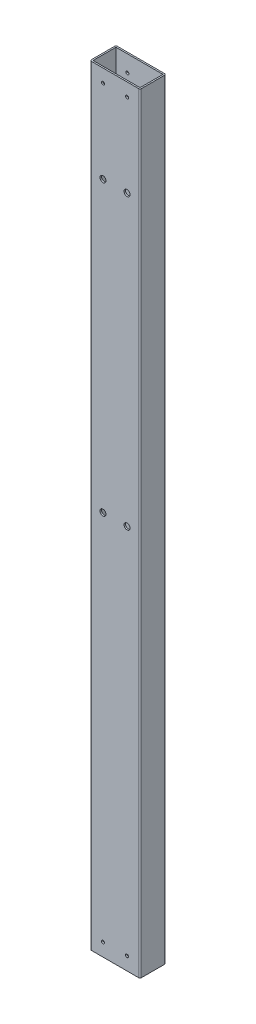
ISO-10303-21;
HEADER;
FILE_DESCRIPTION(('STEP AP214'),'2;1');
FILE_NAME('part.step','',(''),(''),'','','');
FILE_SCHEMA(('AUTOMOTIVE_DESIGN { 1 0 10303 214 1 1 1 1 }'));
ENDSEC;
DATA;
#1=APPLICATION_CONTEXT('core data for automotive mechanical design processes');
#2=APPLICATION_PROTOCOL_DEFINITION('international standard','automotive_design',2000,#1);
#3=PRODUCT_CONTEXT('',#1,'mechanical');
#4=PRODUCT('Part','Part','',(#3));
#5=PRODUCT_RELATED_PRODUCT_CATEGORY('part','',(#4));
#6=PRODUCT_DEFINITION_FORMATION('','',#4);
#7=PRODUCT_DEFINITION_CONTEXT('part definition',#1,'design');
#8=PRODUCT_DEFINITION('design','',#6,#7);
#9=PRODUCT_DEFINITION_SHAPE('','',#8);
#10=(LENGTH_UNIT() NAMED_UNIT(*) SI_UNIT(.MILLI.,.METRE.));
#11=(NAMED_UNIT(*) PLANE_ANGLE_UNIT() SI_UNIT($,.RADIAN.));
#12=(NAMED_UNIT(*) SI_UNIT($,.STERADIAN.) SOLID_ANGLE_UNIT());
#13=UNCERTAINTY_MEASURE_WITH_UNIT(LENGTH_MEASURE(1.E-05),#10,'distance_accuracy_value','');
#14=(GEOMETRIC_REPRESENTATION_CONTEXT(3) GLOBAL_UNCERTAINTY_ASSIGNED_CONTEXT((#13)) GLOBAL_UNIT_ASSIGNED_CONTEXT((#10,
#11,#12)) REPRESENTATION_CONTEXT('',''));
#15=CARTESIAN_POINT('',(0.,0.,0.));
#16=DIRECTION('',(0.,0.,1.));
#17=DIRECTION('',(1.,0.,0.));
#18=AXIS2_PLACEMENT_3D('',#15,#16,#17);
#19=CARTESIAN_POINT('',(-24.8285,406.4,12.1285));
#20=DIRECTION('',(0.,1.,0.));
#21=DIRECTION('',(0.,0.,1.));
#22=AXIS2_PLACEMENT_3D('',#19,#20,#21);
#23=PLANE('',#22);
#24=CARTESIAN_POINT('',(-24.8285,406.4,12.1285));
#25=DIRECTION('',(0.,1.,0.));
#26=DIRECTION('',(0.,0.,-1.));
#27=AXIS2_PLACEMENT_3D('',#24,#25,#26);
#28=CIRCLE('',#27,1.5875);
#29=CARTESIAN_POINT('',(-26.416,406.4,12.1285));
#30=VERTEX_POINT('',#29);
#31=CARTESIAN_POINT('',(-24.8285,406.4,13.716));
#32=VERTEX_POINT('',#31);
#33=EDGE_CURVE('E226',#30,#32,#28,.T.);
#34=ORIENTED_EDGE('',*,*,#33,.T.);
#35=DIRECTION('',(1.,0.,0.));
#36=VECTOR('',#35,1.);
#37=CARTESIAN_POINT('',(-24.8285,406.4,13.716));
#38=LINE('',#37,#36);
#39=CARTESIAN_POINT('',(24.8285,406.4,13.716));
#40=VERTEX_POINT('',#39);
#41=EDGE_CURVE('E230',#32,#40,#38,.T.);
#42=ORIENTED_EDGE('',*,*,#41,.T.);
#43=CARTESIAN_POINT('',(24.8285,406.4,12.1285));
#44=DIRECTION('',(0.,1.,0.));
#45=DIRECTION('',(0.,0.,1.));
#46=AXIS2_PLACEMENT_3D('',#43,#44,#45);
#47=CIRCLE('',#46,1.5875);
#48=CARTESIAN_POINT('',(26.416,406.4,12.1285));
#49=VERTEX_POINT('',#48);
#50=EDGE_CURVE('E234',#40,#49,#47,.T.);
#51=ORIENTED_EDGE('',*,*,#50,.T.);
#52=DIRECTION('',(0.,0.,-1.));
#53=VECTOR('',#52,1.);
#54=CARTESIAN_POINT('',(26.416,406.4,12.1285));
#55=LINE('',#54,#53);
#56=CARTESIAN_POINT('',(26.416,406.4,-12.1285));
#57=VERTEX_POINT('',#56);
#58=EDGE_CURVE('E237',#49,#57,#55,.T.);
#59=ORIENTED_EDGE('',*,*,#58,.T.);
#60=CARTESIAN_POINT('',(24.8285,406.4,-12.1285));
#61=DIRECTION('',(0.,1.,0.));
#62=DIRECTION('',(0.,0.,-1.));
#63=AXIS2_PLACEMENT_3D('',#60,#61,#62);
#64=CIRCLE('',#63,1.5875);
#65=CARTESIAN_POINT('',(24.8285,406.4,-13.716));
#66=VERTEX_POINT('',#65);
#67=EDGE_CURVE('E240',#57,#66,#64,.T.);
#68=ORIENTED_EDGE('',*,*,#67,.T.);
#69=DIRECTION('',(-1.,0.,0.));
#70=VECTOR('',#69,1.);
#71=CARTESIAN_POINT('',(-24.8285,406.4,-13.716));
#72=LINE('',#71,#70);
#73=CARTESIAN_POINT('',(-24.8285,406.4,-13.716));
#74=VERTEX_POINT('',#73);
#75=EDGE_CURVE('E243',#66,#74,#72,.T.);
#76=ORIENTED_EDGE('',*,*,#75,.T.);
#77=CARTESIAN_POINT('',(-24.8285,406.4,-12.1285));
#78=DIRECTION('',(0.,1.,0.));
#79=DIRECTION('',(0.,0.,-1.));
#80=AXIS2_PLACEMENT_3D('',#77,#78,#79);
#81=CIRCLE('',#80,1.5875);
#82=CARTESIAN_POINT('',(-26.416,406.4,-12.1285));
#83=VERTEX_POINT('',#82);
#84=EDGE_CURVE('E246',#74,#83,#81,.T.);
#85=ORIENTED_EDGE('',*,*,#84,.T.);
#86=DIRECTION('',(0.,0.,1.));
#87=VECTOR('',#86,1.);
#88=CARTESIAN_POINT('',(-26.416,406.4,12.1285));
#89=LINE('',#88,#87);
#90=EDGE_CURVE('E249',#83,#30,#89,.T.);
#91=ORIENTED_EDGE('',*,*,#90,.T.);
#92=EDGE_LOOP('',(#34,#42,#51,#59,#68,#76,#85,#91));
#93=FACE_BOUND('',#92,.T.);
#94=DIRECTION('',(1.,0.,0.));
#95=VECTOR('',#94,1.);
#96=CARTESIAN_POINT('',(-24.8285,406.4,12.1285));
#97=LINE('',#96,#95);
#98=CARTESIAN_POINT('',(-24.8285,406.4,12.1285));
#99=VERTEX_POINT('',#98);
#100=CARTESIAN_POINT('',(24.8285,406.4,12.1285));
#101=VERTEX_POINT('',#100);
#102=EDGE_CURVE('E185',#99,#101,#97,.T.);
#103=ORIENTED_EDGE('',*,*,#102,.F.);
#104=DIRECTION('',(0.,0.,1.));
#105=VECTOR('',#104,1.);
#106=CARTESIAN_POINT('',(-24.8285,406.4,12.1285));
#107=LINE('',#106,#105);
#108=CARTESIAN_POINT('',(-24.8285,406.4,-12.1285));
#109=VERTEX_POINT('',#108);
#110=EDGE_CURVE('E176',#109,#99,#107,.T.);
#111=ORIENTED_EDGE('',*,*,#110,.F.);
#112=DIRECTION('',(-1.,0.,0.));
#113=VECTOR('',#112,1.);
#114=CARTESIAN_POINT('',(-24.8285,406.4,-12.1285));
#115=LINE('',#114,#113);
#116=CARTESIAN_POINT('',(24.8285,406.4,-12.1285));
#117=VERTEX_POINT('',#116);
#118=EDGE_CURVE('E202',#117,#109,#115,.T.);
#119=ORIENTED_EDGE('',*,*,#118,.F.);
#120=DIRECTION('',(0.,0.,-1.));
#121=VECTOR('',#120,1.);
#122=CARTESIAN_POINT('',(24.8285,406.4,12.1285));
#123=LINE('',#122,#121);
#124=EDGE_CURVE('E198',#101,#117,#123,.T.);
#125=ORIENTED_EDGE('',*,*,#124,.F.);
#126=EDGE_LOOP('',(#103,#111,#119,#125));
#127=FACE_BOUND('',#126,.T.);
#128=ADVANCED_FACE('F84',(#93,#127),#23,.T.);
#129=CARTESIAN_POINT('',(-24.8285,-406.4,12.1285));
#130=DIRECTION('',(0.,1.,0.));
#131=DIRECTION('',(0.,0.,1.));
#132=AXIS2_PLACEMENT_3D('',#129,#130,#131);
#133=PLANE('',#132);
#134=CARTESIAN_POINT('',(-24.8285,-406.4,12.1285));
#135=DIRECTION('',(0.,1.,0.));
#136=DIRECTION('',(0.,0.,-1.));
#137=AXIS2_PLACEMENT_3D('',#134,#135,#136);
#138=CIRCLE('',#137,1.5875);
#139=CARTESIAN_POINT('',(-26.416,-406.4,12.1285));
#140=VERTEX_POINT('',#139);
#141=CARTESIAN_POINT('',(-24.8285,-406.4,13.716));
#142=VERTEX_POINT('',#141);
#143=EDGE_CURVE('E194',#140,#142,#138,.T.);
#144=ORIENTED_EDGE('',*,*,#143,.F.);
#145=DIRECTION('',(0.,0.,1.));
#146=VECTOR('',#145,1.);
#147=CARTESIAN_POINT('',(-26.416,-406.4,12.1285));
#148=LINE('',#147,#146);
#149=CARTESIAN_POINT('',(-26.416,-406.4,-12.1285));
#150=VERTEX_POINT('',#149);
#151=EDGE_CURVE('E231',#150,#140,#148,.T.);
#152=ORIENTED_EDGE('',*,*,#151,.F.);
#153=CARTESIAN_POINT('',(-24.8285,-406.4,-12.1285));
#154=DIRECTION('',(0.,1.,0.));
#155=DIRECTION('',(0.,0.,-1.));
#156=AXIS2_PLACEMENT_3D('',#153,#154,#155);
#157=CIRCLE('',#156,1.5875);
#158=CARTESIAN_POINT('',(-24.8285,-406.4,-13.716));
#159=VERTEX_POINT('',#158);
#160=EDGE_CURVE('E271',#159,#150,#157,.T.);
#161=ORIENTED_EDGE('',*,*,#160,.F.);
#162=DIRECTION('',(-1.,0.,0.));
#163=VECTOR('',#162,1.);
#164=CARTESIAN_POINT('',(-24.8285,-406.4,-13.716));
#165=LINE('',#164,#163);
#166=CARTESIAN_POINT('',(24.8285,-406.4,-13.716));
#167=VERTEX_POINT('',#166);
#168=EDGE_CURVE('E268',#167,#159,#165,.T.);
#169=ORIENTED_EDGE('',*,*,#168,.F.);
#170=CARTESIAN_POINT('',(24.8285,-406.4,-12.1285));
#171=DIRECTION('',(0.,1.,0.));
#172=DIRECTION('',(0.,0.,-1.));
#173=AXIS2_PLACEMENT_3D('',#170,#171,#172);
#174=CIRCLE('',#173,1.5875);
#175=CARTESIAN_POINT('',(26.416,-406.4,-12.1285));
#176=VERTEX_POINT('',#175);
#177=EDGE_CURVE('E265',#176,#167,#174,.T.);
#178=ORIENTED_EDGE('',*,*,#177,.F.);
#179=DIRECTION('',(0.,0.,-1.));
#180=VECTOR('',#179,1.);
#181=CARTESIAN_POINT('',(26.416,-406.4,12.1285));
#182=LINE('',#181,#180);
#183=CARTESIAN_POINT('',(26.416,-406.4,12.1285));
#184=VERTEX_POINT('',#183);
#185=EDGE_CURVE('E262',#184,#176,#182,.T.);
#186=ORIENTED_EDGE('',*,*,#185,.F.);
#187=CARTESIAN_POINT('',(24.8285,-406.4,12.1285));
#188=DIRECTION('',(0.,1.,0.));
#189=DIRECTION('',(0.,0.,1.));
#190=AXIS2_PLACEMENT_3D('',#187,#188,#189);
#191=CIRCLE('',#190,1.5875);
#192=CARTESIAN_POINT('',(24.8285,-406.4,13.716));
#193=VERTEX_POINT('',#192);
#194=EDGE_CURVE('E259',#193,#184,#191,.T.);
#195=ORIENTED_EDGE('',*,*,#194,.F.);
#196=DIRECTION('',(1.,0.,0.));
#197=VECTOR('',#196,1.);
#198=CARTESIAN_POINT('',(-24.8285,-406.4,13.716));
#199=LINE('',#198,#197);
#200=EDGE_CURVE('E256',#142,#193,#199,.T.);
#201=ORIENTED_EDGE('',*,*,#200,.F.);
#202=EDGE_LOOP('',(#144,#152,#161,#169,#178,#186,#195,#201));
#203=FACE_BOUND('',#202,.T.);
#204=DIRECTION('',(0.,0.,1.));
#205=VECTOR('',#204,1.);
#206=CARTESIAN_POINT('',(-24.8285,-406.4,12.1285));
#207=LINE('',#206,#205);
#208=CARTESIAN_POINT('',(-24.8285,-406.4,-12.1285));
#209=VERTEX_POINT('',#208);
#210=CARTESIAN_POINT('',(-24.8285,-406.4,12.1285));
#211=VERTEX_POINT('',#210);
#212=EDGE_CURVE('E110',#209,#211,#207,.T.);
#213=ORIENTED_EDGE('',*,*,#212,.T.);
#214=DIRECTION('',(1.,0.,0.));
#215=VECTOR('',#214,1.);
#216=CARTESIAN_POINT('',(-24.8285,-406.4,12.1285));
#217=LINE('',#216,#215);
#218=CARTESIAN_POINT('',(24.8285,-406.4,12.1285));
#219=VERTEX_POINT('',#218);
#220=EDGE_CURVE('E192',#211,#219,#217,.T.);
#221=ORIENTED_EDGE('',*,*,#220,.T.);
#222=DIRECTION('',(0.,0.,-1.));
#223=VECTOR('',#222,1.);
#224=CARTESIAN_POINT('',(24.8285,-406.4,12.1285));
#225=LINE('',#224,#223);
#226=CARTESIAN_POINT('',(24.8285,-406.4,-12.1285));
#227=VERTEX_POINT('',#226);
#228=EDGE_CURVE('E213',#219,#227,#225,.T.);
#229=ORIENTED_EDGE('',*,*,#228,.T.);
#230=DIRECTION('',(-1.,0.,0.));
#231=VECTOR('',#230,1.);
#232=CARTESIAN_POINT('',(-24.8285,-406.4,-12.1285));
#233=LINE('',#232,#231);
#234=EDGE_CURVE('E186',#227,#209,#233,.T.);
#235=ORIENTED_EDGE('',*,*,#234,.T.);
#236=EDGE_LOOP('',(#213,#221,#229,#235));
#237=FACE_BOUND('',#236,.T.);
#238=ADVANCED_FACE('F452',(#203,#237),#133,.F.);
#239=CARTESIAN_POINT('',(-24.8285,406.4,12.1285));
#240=DIRECTION('',(0.,-1.,0.));
#241=DIRECTION('',(0.,0.,-1.));
#242=AXIS2_PLACEMENT_3D('',#239,#240,#241);
#243=CYLINDRICAL_SURFACE('',#242,1.5875);
#244=ORIENTED_EDGE('',*,*,#143,.T.);
#245=DIRECTION('',(0.,-1.,0.));
#246=VECTOR('',#245,1.);
#247=CARTESIAN_POINT('',(-24.8285,406.4,13.716));
#248=LINE('',#247,#246);
#249=EDGE_CURVE('E12',#32,#142,#248,.T.);
#250=ORIENTED_EDGE('',*,*,#249,.F.);
#251=ORIENTED_EDGE('',*,*,#33,.F.);
#252=DIRECTION('',(0.,-1.,0.));
#253=VECTOR('',#252,1.);
#254=CARTESIAN_POINT('',(-26.416,406.4,12.1285));
#255=LINE('',#254,#253);
#256=EDGE_CURVE('E252',#30,#140,#255,.T.);
#257=ORIENTED_EDGE('',*,*,#256,.T.);
#258=EDGE_LOOP('',(#244,#250,#251,#257));
#259=FACE_BOUND('',#258,.T.);
#260=ADVANCED_FACE('F86',(#259),#243,.T.);
#261=CARTESIAN_POINT('',(-24.8285,406.4,13.716));
#262=DIRECTION('',(0.,0.,-1.));
#263=DIRECTION('',(-1.,0.,0.));
#264=AXIS2_PLACEMENT_3D('',#261,#262,#263);
#265=PLANE('',#264);
#266=CARTESIAN_POINT('',(-12.7,-392.557,13.716));
#267=DIRECTION('',(0.,0.,1.));
#268=DIRECTION('',(1.,0.,0.));
#269=AXIS2_PLACEMENT_3D('',#266,#267,#268);
#270=CIRCLE('',#269,1.5875);
#271=CARTESIAN_POINT('',(-11.1125,-392.557,13.716));
#272=VERTEX_POINT('',#271);
#273=EDGE_CURVE('E355',#272,#272,#270,.T.);
#274=ORIENTED_EDGE('',*,*,#273,.F.);
#275=EDGE_LOOP('',(#274));
#276=FACE_BOUND('',#275,.T.);
#277=CARTESIAN_POINT('',(12.7,-392.557,13.716));
#278=DIRECTION('',(0.,0.,1.));
#279=DIRECTION('',(1.,0.,0.));
#280=AXIS2_PLACEMENT_3D('',#277,#278,#279);
#281=CIRCLE('',#280,1.5875);
#282=CARTESIAN_POINT('',(14.2875,-392.557,13.716));
#283=VERTEX_POINT('',#282);
#284=EDGE_CURVE('E360',#283,#283,#281,.T.);
#285=ORIENTED_EDGE('',*,*,#284,.F.);
#286=EDGE_LOOP('',(#285));
#287=FACE_BOUND('',#286,.T.);
#288=CARTESIAN_POINT('',(12.7,392.557,13.716));
#289=DIRECTION('',(0.,0.,1.));
#290=DIRECTION('',(1.,0.,0.));
#291=AXIS2_PLACEMENT_3D('',#288,#289,#290);
#292=CIRCLE('',#291,1.5875);
#293=CARTESIAN_POINT('',(14.2875,392.557,13.716));
#294=VERTEX_POINT('',#293);
#295=EDGE_CURVE('E366',#294,#294,#292,.T.);
#296=ORIENTED_EDGE('',*,*,#295,.F.);
#297=EDGE_LOOP('',(#296));
#298=FACE_BOUND('',#297,.T.);
#299=CARTESIAN_POINT('',(-12.7,392.557,13.716));
#300=DIRECTION('',(0.,0.,1.));
#301=DIRECTION('',(1.,0.,0.));
#302=AXIS2_PLACEMENT_3D('',#299,#300,#301);
#303=CIRCLE('',#302,1.5875);
#304=CARTESIAN_POINT('',(-11.1125,392.557,13.716));
#305=VERTEX_POINT('',#304);
#306=EDGE_CURVE('E327',#305,#305,#303,.T.);
#307=ORIENTED_EDGE('',*,*,#306,.F.);
#308=EDGE_LOOP('',(#307));
#309=FACE_BOUND('',#308,.T.);
#310=CARTESIAN_POINT('',(12.7,0.,13.716));
#311=DIRECTION('',(0.,0.,1.));
#312=DIRECTION('',(1.,0.,0.));
#313=AXIS2_PLACEMENT_3D('',#310,#311,#312);
#314=CIRCLE('',#313,3.175);
#315=CARTESIAN_POINT('',(15.875,0.,13.716));
#316=VERTEX_POINT('',#315);
#317=EDGE_CURVE('E381',#316,#316,#314,.T.);
#318=ORIENTED_EDGE('',*,*,#317,.F.);
#319=EDGE_LOOP('',(#318));
#320=FACE_BOUND('',#319,.T.);
#321=CARTESIAN_POINT('',(-12.7,304.8,13.716));
#322=DIRECTION('',(0.,0.,1.));
#323=DIRECTION('',(1.,0.,0.));
#324=AXIS2_PLACEMENT_3D('',#321,#322,#323);
#325=CIRCLE('',#324,3.175);
#326=CARTESIAN_POINT('',(-9.525,304.8,13.716));
#327=VERTEX_POINT('',#326);
#328=EDGE_CURVE('E390',#327,#327,#325,.T.);
#329=ORIENTED_EDGE('',*,*,#328,.F.);
#330=EDGE_LOOP('',(#329));
#331=FACE_BOUND('',#330,.T.);
#332=CARTESIAN_POINT('',(12.7,304.8,13.716));
#333=DIRECTION('',(0.,0.,1.));
#334=DIRECTION('',(1.,0.,0.));
#335=AXIS2_PLACEMENT_3D('',#332,#333,#334);
#336=CIRCLE('',#335,3.175);
#337=CARTESIAN_POINT('',(15.875,304.8,13.716));
#338=VERTEX_POINT('',#337);
#339=EDGE_CURVE('E373',#338,#338,#336,.T.);
#340=ORIENTED_EDGE('',*,*,#339,.F.);
#341=EDGE_LOOP('',(#340));
#342=FACE_BOUND('',#341,.T.);
#343=CARTESIAN_POINT('',(-12.7,0.,13.716));
#344=DIRECTION('',(0.,0.,1.));
#345=DIRECTION('',(1.,0.,0.));
#346=AXIS2_PLACEMENT_3D('',#343,#344,#345);
#347=CIRCLE('',#346,3.175);
#348=CARTESIAN_POINT('',(-9.525,0.,13.716));
#349=VERTEX_POINT('',#348);
#350=EDGE_CURVE('E385',#349,#349,#347,.T.);
#351=ORIENTED_EDGE('',*,*,#350,.F.);
#352=EDGE_LOOP('',(#351));
#353=FACE_BOUND('',#352,.T.);
#354=ORIENTED_EDGE('',*,*,#200,.T.);
#355=DIRECTION('',(0.,-1.,0.));
#356=VECTOR('',#355,1.);
#357=CARTESIAN_POINT('',(24.8285,406.4,13.716));
#358=LINE('',#357,#356);
#359=EDGE_CURVE('E94',#40,#193,#358,.T.);
#360=ORIENTED_EDGE('',*,*,#359,.F.);
#361=ORIENTED_EDGE('',*,*,#41,.F.);
#362=ORIENTED_EDGE('',*,*,#249,.T.);
#363=EDGE_LOOP('',(#354,#360,#361,#362));
#364=FACE_BOUND('',#363,.T.);
#365=ADVANCED_FACE('F438',(#276,#287,#298,#309,#320,#331,#342,#353,#364),#265,.F.);
#366=CARTESIAN_POINT('',(24.8285,406.4,12.1285));
#367=DIRECTION('',(0.,-1.,0.));
#368=DIRECTION('',(0.,0.,-1.));
#369=AXIS2_PLACEMENT_3D('',#366,#367,#368);
#370=CYLINDRICAL_SURFACE('',#369,1.5875);
#371=ORIENTED_EDGE('',*,*,#194,.T.);
#372=DIRECTION('',(0.,-1.,0.));
#373=VECTOR('',#372,1.);
#374=CARTESIAN_POINT('',(26.416,406.4,12.1285));
#375=LINE('',#374,#373);
#376=EDGE_CURVE('E295',#49,#184,#375,.T.);
#377=ORIENTED_EDGE('',*,*,#376,.F.);
#378=ORIENTED_EDGE('',*,*,#50,.F.);
#379=ORIENTED_EDGE('',*,*,#359,.T.);
#380=EDGE_LOOP('',(#371,#377,#378,#379));
#381=FACE_BOUND('',#380,.T.);
#382=ADVANCED_FACE('F441',(#381),#370,.T.);
#383=CARTESIAN_POINT('',(26.416,406.4,12.1285));
#384=DIRECTION('',(-1.,0.,0.));
#385=DIRECTION('',(0.,0.,1.));
#386=AXIS2_PLACEMENT_3D('',#383,#384,#385);
#387=PLANE('',#386);
#388=ORIENTED_EDGE('',*,*,#185,.T.);
#389=DIRECTION('',(0.,-1.,0.));
#390=VECTOR('',#389,1.);
#391=CARTESIAN_POINT('',(26.416,406.4,-12.1285));
#392=LINE('',#391,#390);
#393=EDGE_CURVE('E291',#57,#176,#392,.T.);
#394=ORIENTED_EDGE('',*,*,#393,.F.);
#395=ORIENTED_EDGE('',*,*,#58,.F.);
#396=ORIENTED_EDGE('',*,*,#376,.T.);
#397=EDGE_LOOP('',(#388,#394,#395,#396));
#398=FACE_BOUND('',#397,.T.);
#399=ADVANCED_FACE('F458',(#398),#387,.F.);
#400=CARTESIAN_POINT('',(24.8285,406.4,-12.1285));
#401=DIRECTION('',(0.,-1.,0.));
#402=DIRECTION('',(0.,0.,-1.));
#403=AXIS2_PLACEMENT_3D('',#400,#401,#402);
#404=CYLINDRICAL_SURFACE('',#403,1.5875);
#405=ORIENTED_EDGE('',*,*,#177,.T.);
#406=DIRECTION('',(0.,-1.,0.));
#407=VECTOR('',#406,1.);
#408=CARTESIAN_POINT('',(24.8285,406.4,-13.716));
#409=LINE('',#408,#407);
#410=EDGE_CURVE('E287',#66,#167,#409,.T.);
#411=ORIENTED_EDGE('',*,*,#410,.F.);
#412=ORIENTED_EDGE('',*,*,#67,.F.);
#413=ORIENTED_EDGE('',*,*,#393,.T.);
#414=EDGE_LOOP('',(#405,#411,#412,#413));
#415=FACE_BOUND('',#414,.T.);
#416=ADVANCED_FACE('F462',(#415),#404,.T.);
#417=CARTESIAN_POINT('',(-24.8285,406.4,-13.716));
#418=DIRECTION('',(0.,0.,1.));
#419=DIRECTION('',(1.,0.,0.));
#420=AXIS2_PLACEMENT_3D('',#417,#418,#419);
#421=PLANE('',#420);
#422=CARTESIAN_POINT('',(12.6999999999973,388.9375,-13.716));
#423=DIRECTION('',(0.,0.,1.));
#424=DIRECTION('',(1.,0.,0.));
#425=AXIS2_PLACEMENT_3D('',#422,#423,#424);
#426=CIRCLE('',#425,1.58749999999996);
#427=CARTESIAN_POINT('',(14.2874999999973,388.9375,-13.716));
#428=VERTEX_POINT('',#427);
#429=EDGE_CURVE('E708',#428,#428,#426,.T.);
#430=ORIENTED_EDGE('',*,*,#429,.T.);
#431=EDGE_LOOP('',(#430));
#432=FACE_BOUND('',#431,.T.);
#433=CARTESIAN_POINT('',(-12.7000000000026,388.9375,-13.716));
#434=DIRECTION('',(0.,0.,1.));
#435=DIRECTION('',(1.,0.,0.));
#436=AXIS2_PLACEMENT_3D('',#433,#434,#435);
#437=CIRCLE('',#436,1.5875);
#438=CARTESIAN_POINT('',(-11.1125000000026,388.9375,-13.716));
#439=VERTEX_POINT('',#438);
#440=EDGE_CURVE('E705',#439,#439,#437,.T.);
#441=ORIENTED_EDGE('',*,*,#440,.T.);
#442=EDGE_LOOP('',(#441));
#443=FACE_BOUND('',#442,.T.);
#444=CARTESIAN_POINT('',(-12.6999999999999,-388.9375,-13.716));
#445=DIRECTION('',(0.,0.,1.));
#446=DIRECTION('',(1.,0.,0.));
#447=AXIS2_PLACEMENT_3D('',#444,#445,#446);
#448=CIRCLE('',#447,1.5875);
#449=CARTESIAN_POINT('',(-11.1124999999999,-388.9375,-13.716));
#450=VERTEX_POINT('',#449);
#451=EDGE_CURVE('E701',#450,#450,#448,.T.);
#452=ORIENTED_EDGE('',*,*,#451,.T.);
#453=EDGE_LOOP('',(#452));
#454=FACE_BOUND('',#453,.T.);
#455=CARTESIAN_POINT('',(12.7,-388.9375,-13.716));
#456=DIRECTION('',(0.,0.,1.));
#457=DIRECTION('',(1.,0.,0.));
#458=AXIS2_PLACEMENT_3D('',#455,#456,#457);
#459=CIRCLE('',#458,1.58749999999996);
#460=CARTESIAN_POINT('',(14.2874999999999,-388.9375,-13.716));
#461=VERTEX_POINT('',#460);
#462=EDGE_CURVE('E345',#461,#461,#459,.T.);
#463=ORIENTED_EDGE('',*,*,#462,.T.);
#464=EDGE_LOOP('',(#463));
#465=FACE_BOUND('',#464,.T.);
#466=CARTESIAN_POINT('',(12.7,0.,-13.716));
#467=DIRECTION('',(0.,0.,1.));
#468=DIRECTION('',(1.,0.,0.));
#469=AXIS2_PLACEMENT_3D('',#466,#467,#468);
#470=CIRCLE('',#469,3.175);
#471=CARTESIAN_POINT('',(15.875,0.,-13.716));
#472=VERTEX_POINT('',#471);
#473=EDGE_CURVE('E386',#472,#472,#470,.T.);
#474=ORIENTED_EDGE('',*,*,#473,.T.);
#475=EDGE_LOOP('',(#474));
#476=FACE_BOUND('',#475,.T.);
#477=CARTESIAN_POINT('',(-12.7,304.8,-13.716));
#478=DIRECTION('',(0.,0.,1.));
#479=DIRECTION('',(1.,0.,0.));
#480=AXIS2_PLACEMENT_3D('',#477,#478,#479);
#481=CIRCLE('',#480,3.175);
#482=CARTESIAN_POINT('',(-9.525,304.8,-13.716));
#483=VERTEX_POINT('',#482);
#484=EDGE_CURVE('E377',#483,#483,#481,.T.);
#485=ORIENTED_EDGE('',*,*,#484,.T.);
#486=EDGE_LOOP('',(#485));
#487=FACE_BOUND('',#486,.T.);
#488=CARTESIAN_POINT('',(12.7,304.8,-13.716));
#489=DIRECTION('',(0.,0.,1.));
#490=DIRECTION('',(1.,0.,0.));
#491=AXIS2_PLACEMENT_3D('',#488,#489,#490);
#492=CIRCLE('',#491,3.175);
#493=CARTESIAN_POINT('',(15.875,304.8,-13.716));
#494=VERTEX_POINT('',#493);
#495=EDGE_CURVE('E339',#494,#494,#492,.T.);
#496=ORIENTED_EDGE('',*,*,#495,.T.);
#497=EDGE_LOOP('',(#496));
#498=FACE_BOUND('',#497,.T.);
#499=CARTESIAN_POINT('',(-12.7,0.,-13.716));
#500=DIRECTION('',(0.,0.,1.));
#501=DIRECTION('',(1.,0.,0.));
#502=AXIS2_PLACEMENT_3D('',#499,#500,#501);
#503=CIRCLE('',#502,3.175);
#504=CARTESIAN_POINT('',(-9.525,0.,-13.716));
#505=VERTEX_POINT('',#504);
#506=EDGE_CURVE('E307',#505,#505,#503,.T.);
#507=ORIENTED_EDGE('',*,*,#506,.T.);
#508=EDGE_LOOP('',(#507));
#509=FACE_BOUND('',#508,.T.);
#510=ORIENTED_EDGE('',*,*,#168,.T.);
#511=DIRECTION('',(0.,-1.,0.));
#512=VECTOR('',#511,1.);
#513=CARTESIAN_POINT('',(-24.8285,406.4,-13.716));
#514=LINE('',#513,#512);
#515=EDGE_CURVE('E283',#74,#159,#514,.T.);
#516=ORIENTED_EDGE('',*,*,#515,.F.);
#517=ORIENTED_EDGE('',*,*,#75,.F.);
#518=ORIENTED_EDGE('',*,*,#410,.T.);
#519=EDGE_LOOP('',(#510,#516,#517,#518));
#520=FACE_BOUND('',#519,.T.);
#521=ADVANCED_FACE('F480',(#432,#443,#454,#465,#476,#487,#498,#509,#520),#421,.F.);
#522=CARTESIAN_POINT('',(-24.8285,406.4,-12.1285));
#523=DIRECTION('',(0.,-1.,0.));
#524=DIRECTION('',(0.,0.,-1.));
#525=AXIS2_PLACEMENT_3D('',#522,#523,#524);
#526=CYLINDRICAL_SURFACE('',#525,1.5875);
#527=ORIENTED_EDGE('',*,*,#160,.T.);
#528=DIRECTION('',(0.,-1.,0.));
#529=VECTOR('',#528,1.);
#530=CARTESIAN_POINT('',(-26.416,406.4,-12.1285));
#531=LINE('',#530,#529);
#532=EDGE_CURVE('E279',#83,#150,#531,.T.);
#533=ORIENTED_EDGE('',*,*,#532,.F.);
#534=ORIENTED_EDGE('',*,*,#84,.F.);
#535=ORIENTED_EDGE('',*,*,#515,.T.);
#536=EDGE_LOOP('',(#527,#533,#534,#535));
#537=FACE_BOUND('',#536,.T.);
#538=ADVANCED_FACE('F478',(#537),#526,.T.);
#539=CARTESIAN_POINT('',(-26.416,406.4,12.1285));
#540=DIRECTION('',(1.,0.,0.));
#541=DIRECTION('',(0.,0.,-1.));
#542=AXIS2_PLACEMENT_3D('',#539,#540,#541);
#543=PLANE('',#542);
#544=ORIENTED_EDGE('',*,*,#151,.T.);
#545=ORIENTED_EDGE('',*,*,#256,.F.);
#546=ORIENTED_EDGE('',*,*,#90,.F.);
#547=ORIENTED_EDGE('',*,*,#532,.T.);
#548=EDGE_LOOP('',(#544,#545,#546,#547));
#549=FACE_BOUND('',#548,.T.);
#550=ADVANCED_FACE('F474',(#549),#543,.F.);
#551=CARTESIAN_POINT('',(-24.8285,406.4,12.1285));
#552=DIRECTION('',(1.,0.,0.));
#553=DIRECTION('',(0.,0.,-1.));
#554=AXIS2_PLACEMENT_3D('',#551,#552,#553);
#555=PLANE('',#554);
#556=ORIENTED_EDGE('',*,*,#212,.F.);
#557=DIRECTION('',(0.,-1.,0.));
#558=VECTOR('',#557,1.);
#559=CARTESIAN_POINT('',(-24.8285,406.4,-12.1285));
#560=LINE('',#559,#558);
#561=EDGE_CURVE('E180',#109,#209,#560,.T.);
#562=ORIENTED_EDGE('',*,*,#561,.F.);
#563=ORIENTED_EDGE('',*,*,#110,.T.);
#564=DIRECTION('',(0.,-1.,0.));
#565=VECTOR('',#564,1.);
#566=CARTESIAN_POINT('',(-24.8285,406.4,12.1285));
#567=LINE('',#566,#565);
#568=EDGE_CURVE('E179',#99,#211,#567,.T.);
#569=ORIENTED_EDGE('',*,*,#568,.T.);
#570=EDGE_LOOP('',(#556,#562,#563,#569));
#571=FACE_BOUND('',#570,.T.);
#572=ADVANCED_FACE('F178',(#571),#555,.T.);
#573=CARTESIAN_POINT('',(-24.8285,406.4,12.1285));
#574=DIRECTION('',(0.,0.,-1.));
#575=DIRECTION('',(-1.,0.,0.));
#576=AXIS2_PLACEMENT_3D('',#573,#574,#575);
#577=PLANE('',#576);
#578=CARTESIAN_POINT('',(-12.7,-392.557,12.1285));
#579=DIRECTION('',(0.,0.,-1.));
#580=DIRECTION('',(-1.,0.,0.));
#581=AXIS2_PLACEMENT_3D('',#578,#579,#580);
#582=CIRCLE('',#581,1.5875);
#583=CARTESIAN_POINT('',(-14.2875,-392.557,12.1285));
#584=VERTEX_POINT('',#583);
#585=EDGE_CURVE('E335',#584,#584,#582,.F.);
#586=ORIENTED_EDGE('',*,*,#585,.T.);
#587=EDGE_LOOP('',(#586));
#588=FACE_BOUND('',#587,.T.);
#589=CARTESIAN_POINT('',(12.7,-392.557,12.1285));
#590=DIRECTION('',(0.,0.,-1.));
#591=DIRECTION('',(-1.,0.,0.));
#592=AXIS2_PLACEMENT_3D('',#589,#590,#591);
#593=CIRCLE('',#592,1.5875);
#594=CARTESIAN_POINT('',(11.1125,-392.557,12.1285));
#595=VERTEX_POINT('',#594);
#596=EDGE_CURVE('E331',#595,#595,#593,.F.);
#597=ORIENTED_EDGE('',*,*,#596,.T.);
#598=EDGE_LOOP('',(#597));
#599=FACE_BOUND('',#598,.T.);
#600=CARTESIAN_POINT('',(12.7,392.557,12.1285));
#601=DIRECTION('',(0.,0.,-1.));
#602=DIRECTION('',(-1.,0.,0.));
#603=AXIS2_PLACEMENT_3D('',#600,#601,#602);
#604=CIRCLE('',#603,1.5875);
#605=CARTESIAN_POINT('',(11.1125,392.557,12.1285));
#606=VERTEX_POINT('',#605);
#607=EDGE_CURVE('E326',#606,#606,#604,.F.);
#608=ORIENTED_EDGE('',*,*,#607,.T.);
#609=EDGE_LOOP('',(#608));
#610=FACE_BOUND('',#609,.T.);
#611=CARTESIAN_POINT('',(-12.7,392.557,12.1285));
#612=DIRECTION('',(0.,0.,-1.));
#613=DIRECTION('',(-1.,0.,0.));
#614=AXIS2_PLACEMENT_3D('',#611,#612,#613);
#615=CIRCLE('',#614,1.5875);
#616=CARTESIAN_POINT('',(-14.2875,392.557,12.1285));
#617=VERTEX_POINT('',#616);
#618=EDGE_CURVE('E322',#617,#617,#615,.F.);
#619=ORIENTED_EDGE('',*,*,#618,.T.);
#620=EDGE_LOOP('',(#619));
#621=FACE_BOUND('',#620,.T.);
#622=CARTESIAN_POINT('',(12.7,0.,12.1285));
#623=DIRECTION('',(0.,0.,-1.));
#624=DIRECTION('',(-1.,0.,0.));
#625=AXIS2_PLACEMENT_3D('',#622,#623,#624);
#626=CIRCLE('',#625,3.175);
#627=CARTESIAN_POINT('',(9.525,0.,12.1285));
#628=VERTEX_POINT('',#627);
#629=EDGE_CURVE('E210',#628,#628,#626,.T.);
#630=ORIENTED_EDGE('',*,*,#629,.F.);
#631=EDGE_LOOP('',(#630));
#632=FACE_BOUND('',#631,.T.);
#633=CARTESIAN_POINT('',(-12.7,304.8,12.1285));
#634=DIRECTION('',(0.,0.,-1.));
#635=DIRECTION('',(-1.,0.,0.));
#636=AXIS2_PLACEMENT_3D('',#633,#634,#635);
#637=CIRCLE('',#636,3.175);
#638=CARTESIAN_POINT('',(-15.875,304.8,12.1285));
#639=VERTEX_POINT('',#638);
#640=EDGE_CURVE('E317',#639,#639,#637,.T.);
#641=ORIENTED_EDGE('',*,*,#640,.F.);
#642=EDGE_LOOP('',(#641));
#643=FACE_BOUND('',#642,.T.);
#644=CARTESIAN_POINT('',(12.7,304.8,12.1285));
#645=DIRECTION('',(0.,0.,-1.));
#646=DIRECTION('',(-1.,0.,0.));
#647=AXIS2_PLACEMENT_3D('',#644,#645,#646);
#648=CIRCLE('',#647,3.175);
#649=CARTESIAN_POINT('',(9.525,304.8,12.1285));
#650=VERTEX_POINT('',#649);
#651=EDGE_CURVE('E312',#650,#650,#648,.T.);
#652=ORIENTED_EDGE('',*,*,#651,.F.);
#653=EDGE_LOOP('',(#652));
#654=FACE_BOUND('',#653,.T.);
#655=CARTESIAN_POINT('',(-12.7,0.,12.1285));
#656=DIRECTION('',(0.,0.,-1.));
#657=DIRECTION('',(-1.,0.,0.));
#658=AXIS2_PLACEMENT_3D('',#655,#656,#657);
#659=CIRCLE('',#658,3.175);
#660=CARTESIAN_POINT('',(-15.875,0.,12.1285));
#661=VERTEX_POINT('',#660);
#662=EDGE_CURVE('E306',#661,#661,#659,.T.);
#663=ORIENTED_EDGE('',*,*,#662,.F.);
#664=EDGE_LOOP('',(#663));
#665=FACE_BOUND('',#664,.T.);
#666=ORIENTED_EDGE('',*,*,#220,.F.);
#667=ORIENTED_EDGE('',*,*,#568,.F.);
#668=ORIENTED_EDGE('',*,*,#102,.T.);
#669=DIRECTION('',(0.,-1.,0.));
#670=VECTOR('',#669,1.);
#671=CARTESIAN_POINT('',(24.8285,406.4,12.1285));
#672=LINE('',#671,#670);
#673=EDGE_CURVE('E195',#101,#219,#672,.T.);
#674=ORIENTED_EDGE('',*,*,#673,.T.);
#675=EDGE_LOOP('',(#666,#667,#668,#674));
#676=FACE_BOUND('',#675,.T.);
#677=ADVANCED_FACE('F189',(#588,#599,#610,#621,#632,#643,#654,#665,#676),#577,.T.);
#678=CARTESIAN_POINT('',(24.8285,406.4,12.1285));
#679=DIRECTION('',(-1.,0.,0.));
#680=DIRECTION('',(0.,0.,1.));
#681=AXIS2_PLACEMENT_3D('',#678,#679,#680);
#682=PLANE('',#681);
#683=ORIENTED_EDGE('',*,*,#228,.F.);
#684=ORIENTED_EDGE('',*,*,#673,.F.);
#685=ORIENTED_EDGE('',*,*,#124,.T.);
#686=DIRECTION('',(0.,-1.,0.));
#687=VECTOR('',#686,1.);
#688=CARTESIAN_POINT('',(24.8285,406.4,-12.1285));
#689=LINE('',#688,#687);
#690=EDGE_CURVE('E102',#117,#227,#689,.T.);
#691=ORIENTED_EDGE('',*,*,#690,.T.);
#692=EDGE_LOOP('',(#683,#684,#685,#691));
#693=FACE_BOUND('',#692,.T.);
#694=ADVANCED_FACE('F420',(#693),#682,.T.);
#695=CARTESIAN_POINT('',(-24.8285,406.4,-12.1285));
#696=DIRECTION('',(0.,0.,1.));
#697=DIRECTION('',(1.,0.,0.));
#698=AXIS2_PLACEMENT_3D('',#695,#696,#697);
#699=PLANE('',#698);
#700=CARTESIAN_POINT('',(12.6999999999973,388.9375,-12.1285));
#701=DIRECTION('',(0.,0.,1.));
#702=DIRECTION('',(1.,0.,0.));
#703=AXIS2_PLACEMENT_3D('',#700,#701,#702);
#704=CIRCLE('',#703,1.58749999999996);
#705=CARTESIAN_POINT('',(14.2874999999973,388.9375,-12.1285));
#706=VERTEX_POINT('',#705);
#707=EDGE_CURVE('E88',#706,#706,#704,.T.);
#708=ORIENTED_EDGE('',*,*,#707,.F.);
#709=EDGE_LOOP('',(#708));
#710=FACE_BOUND('',#709,.T.);
#711=CARTESIAN_POINT('',(-12.7000000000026,388.9375,-12.1285));
#712=DIRECTION('',(0.,0.,1.));
#713=DIRECTION('',(1.,0.,0.));
#714=AXIS2_PLACEMENT_3D('',#711,#712,#713);
#715=CIRCLE('',#714,1.5875);
#716=CARTESIAN_POINT('',(-11.1125000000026,388.9375,-12.1285));
#717=VERTEX_POINT('',#716);
#718=EDGE_CURVE('E348',#717,#717,#715,.T.);
#719=ORIENTED_EDGE('',*,*,#718,.F.);
#720=EDGE_LOOP('',(#719));
#721=FACE_BOUND('',#720,.T.);
#722=CARTESIAN_POINT('',(-12.6999999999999,-388.9375,-12.1285));
#723=DIRECTION('',(0.,0.,1.));
#724=DIRECTION('',(1.,0.,0.));
#725=AXIS2_PLACEMENT_3D('',#722,#723,#724);
#726=CIRCLE('',#725,1.5875);
#727=CARTESIAN_POINT('',(-11.1124999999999,-388.9375,-12.1285));
#728=VERTEX_POINT('',#727);
#729=EDGE_CURVE('E344',#728,#728,#726,.T.);
#730=ORIENTED_EDGE('',*,*,#729,.F.);
#731=EDGE_LOOP('',(#730));
#732=FACE_BOUND('',#731,.T.);
#733=CARTESIAN_POINT('',(12.7,-388.9375,-12.1285));
#734=DIRECTION('',(0.,0.,1.));
#735=DIRECTION('',(1.,0.,0.));
#736=AXIS2_PLACEMENT_3D('',#733,#734,#735);
#737=CIRCLE('',#736,1.58749999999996);
#738=CARTESIAN_POINT('',(14.2874999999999,-388.9375,-12.1285));
#739=VERTEX_POINT('',#738);
#740=EDGE_CURVE('E340',#739,#739,#737,.T.);
#741=ORIENTED_EDGE('',*,*,#740,.F.);
#742=EDGE_LOOP('',(#741));
#743=FACE_BOUND('',#742,.T.);
#744=CARTESIAN_POINT('',(12.7,0.,-12.1285));
#745=DIRECTION('',(0.,0.,1.));
#746=DIRECTION('',(1.,0.,0.));
#747=AXIS2_PLACEMENT_3D('',#744,#745,#746);
#748=CIRCLE('',#747,3.175);
#749=CARTESIAN_POINT('',(15.875,0.,-12.1285));
#750=VERTEX_POINT('',#749);
#751=EDGE_CURVE('E318',#750,#750,#748,.T.);
#752=ORIENTED_EDGE('',*,*,#751,.F.);
#753=EDGE_LOOP('',(#752));
#754=FACE_BOUND('',#753,.T.);
#755=CARTESIAN_POINT('',(-12.7,304.8,-12.1285));
#756=DIRECTION('',(0.,0.,1.));
#757=DIRECTION('',(1.,0.,0.));
#758=AXIS2_PLACEMENT_3D('',#755,#756,#757);
#759=CIRCLE('',#758,3.175);
#760=CARTESIAN_POINT('',(-9.525,304.8,-12.1285));
#761=VERTEX_POINT('',#760);
#762=EDGE_CURVE('E313',#761,#761,#759,.T.);
#763=ORIENTED_EDGE('',*,*,#762,.F.);
#764=EDGE_LOOP('',(#763));
#765=FACE_BOUND('',#764,.T.);
#766=CARTESIAN_POINT('',(12.7,304.8,-12.1285));
#767=DIRECTION('',(0.,0.,1.));
#768=DIRECTION('',(1.,0.,0.));
#769=AXIS2_PLACEMENT_3D('',#766,#767,#768);
#770=CIRCLE('',#769,3.175);
#771=CARTESIAN_POINT('',(15.875,304.8,-12.1285));
#772=VERTEX_POINT('',#771);
#773=EDGE_CURVE('E308',#772,#772,#770,.T.);
#774=ORIENTED_EDGE('',*,*,#773,.F.);
#775=EDGE_LOOP('',(#774));
#776=FACE_BOUND('',#775,.T.);
#777=CARTESIAN_POINT('',(-12.7,0.,-12.1285));
#778=DIRECTION('',(0.,0.,1.));
#779=DIRECTION('',(1.,0.,0.));
#780=AXIS2_PLACEMENT_3D('',#777,#778,#779);
#781=CIRCLE('',#780,3.175);
#782=CARTESIAN_POINT('',(-9.525,0.,-12.1285));
#783=VERTEX_POINT('',#782);
#784=EDGE_CURVE('E302',#783,#783,#781,.T.);
#785=ORIENTED_EDGE('',*,*,#784,.F.);
#786=EDGE_LOOP('',(#785));
#787=FACE_BOUND('',#786,.T.);
#788=ORIENTED_EDGE('',*,*,#234,.F.);
#789=ORIENTED_EDGE('',*,*,#690,.F.);
#790=ORIENTED_EDGE('',*,*,#118,.T.);
#791=ORIENTED_EDGE('',*,*,#561,.T.);
#792=EDGE_LOOP('',(#788,#789,#790,#791));
#793=FACE_BOUND('',#792,.T.);
#794=ADVANCED_FACE('F516',(#710,#721,#732,#743,#754,#765,#776,#787,#793),#699,.T.);
#795=CARTESIAN_POINT('',(-12.7,0.,-13.716));
#796=DIRECTION('',(0.,0.,1.));
#797=DIRECTION('',(1.,0.,0.));
#798=AXIS2_PLACEMENT_3D('',#795,#796,#797);
#799=CYLINDRICAL_SURFACE('',#798,3.175);
#800=ORIENTED_EDGE('',*,*,#784,.T.);
#801=EDGE_LOOP('',(#800));
#802=FACE_BOUND('',#801,.T.);
#803=ORIENTED_EDGE('',*,*,#506,.F.);
#804=EDGE_LOOP('',(#803));
#805=FACE_BOUND('',#804,.T.);
#806=ADVANCED_FACE('F435',(#802,#805),#799,.F.);
#807=CARTESIAN_POINT('',(12.7,304.8,-13.716));
#808=DIRECTION('',(0.,0.,1.));
#809=DIRECTION('',(1.,0.,0.));
#810=AXIS2_PLACEMENT_3D('',#807,#808,#809);
#811=CYLINDRICAL_SURFACE('',#810,3.175);
#812=ORIENTED_EDGE('',*,*,#773,.T.);
#813=EDGE_LOOP('',(#812));
#814=FACE_BOUND('',#813,.T.);
#815=ORIENTED_EDGE('',*,*,#495,.F.);
#816=EDGE_LOOP('',(#815));
#817=FACE_BOUND('',#816,.T.);
#818=ADVANCED_FACE('F526',(#814,#817),#811,.F.);
#819=CARTESIAN_POINT('',(-12.7,304.8,-13.716));
#820=DIRECTION('',(0.,0.,1.));
#821=DIRECTION('',(1.,0.,0.));
#822=AXIS2_PLACEMENT_3D('',#819,#820,#821);
#823=CYLINDRICAL_SURFACE('',#822,3.175);
#824=ORIENTED_EDGE('',*,*,#762,.T.);
#825=EDGE_LOOP('',(#824));
#826=FACE_BOUND('',#825,.T.);
#827=ORIENTED_EDGE('',*,*,#484,.F.);
#828=EDGE_LOOP('',(#827));
#829=FACE_BOUND('',#828,.T.);
#830=ADVANCED_FACE('F534',(#826,#829),#823,.F.);
#831=CARTESIAN_POINT('',(12.7,0.,-13.716));
#832=DIRECTION('',(0.,0.,1.));
#833=DIRECTION('',(1.,0.,0.));
#834=AXIS2_PLACEMENT_3D('',#831,#832,#833);
#835=CYLINDRICAL_SURFACE('',#834,3.175);
#836=ORIENTED_EDGE('',*,*,#751,.T.);
#837=EDGE_LOOP('',(#836));
#838=FACE_BOUND('',#837,.T.);
#839=ORIENTED_EDGE('',*,*,#473,.F.);
#840=EDGE_LOOP('',(#839));
#841=FACE_BOUND('',#840,.T.);
#842=ADVANCED_FACE('F433',(#838,#841),#835,.F.);
#843=ORIENTED_EDGE('',*,*,#662,.T.);
#844=EDGE_LOOP('',(#843));
#845=FACE_BOUND('',#844,.T.);
#846=ORIENTED_EDGE('',*,*,#350,.T.);
#847=EDGE_LOOP('',(#846));
#848=FACE_BOUND('',#847,.T.);
#849=ADVANCED_FACE('F429',(#845,#848),#799,.F.);
#850=ORIENTED_EDGE('',*,*,#651,.T.);
#851=EDGE_LOOP('',(#850));
#852=FACE_BOUND('',#851,.T.);
#853=ORIENTED_EDGE('',*,*,#339,.T.);
#854=EDGE_LOOP('',(#853));
#855=FACE_BOUND('',#854,.T.);
#856=ADVANCED_FACE('F432',(#852,#855),#811,.F.);
#857=ORIENTED_EDGE('',*,*,#640,.T.);
#858=EDGE_LOOP('',(#857));
#859=FACE_BOUND('',#858,.T.);
#860=ORIENTED_EDGE('',*,*,#328,.T.);
#861=EDGE_LOOP('',(#860));
#862=FACE_BOUND('',#861,.T.);
#863=ADVANCED_FACE('F545',(#859,#862),#823,.F.);
#864=ORIENTED_EDGE('',*,*,#629,.T.);
#865=EDGE_LOOP('',(#864));
#866=FACE_BOUND('',#865,.T.);
#867=ORIENTED_EDGE('',*,*,#317,.T.);
#868=EDGE_LOOP('',(#867));
#869=FACE_BOUND('',#868,.T.);
#870=ADVANCED_FACE('F415',(#866,#869),#835,.F.);
#871=CARTESIAN_POINT('',(-12.7,392.557,13.716));
#872=DIRECTION('',(0.,0.,-1.));
#873=DIRECTION('',(-1.,0.,0.));
#874=AXIS2_PLACEMENT_3D('',#871,#872,#873);
#875=CYLINDRICAL_SURFACE('',#874,1.5875);
#876=ORIENTED_EDGE('',*,*,#618,.F.);
#877=EDGE_LOOP('',(#876));
#878=FACE_BOUND('',#877,.T.);
#879=ORIENTED_EDGE('',*,*,#306,.T.);
#880=EDGE_LOOP('',(#879));
#881=FACE_BOUND('',#880,.T.);
#882=ADVANCED_FACE('F578',(#878,#881),#875,.F.);
#883=CARTESIAN_POINT('',(12.7,392.557,13.716));
#884=DIRECTION('',(0.,0.,-1.));
#885=DIRECTION('',(-1.,0.,0.));
#886=AXIS2_PLACEMENT_3D('',#883,#884,#885);
#887=CYLINDRICAL_SURFACE('',#886,1.5875);
#888=ORIENTED_EDGE('',*,*,#607,.F.);
#889=EDGE_LOOP('',(#888));
#890=FACE_BOUND('',#889,.T.);
#891=ORIENTED_EDGE('',*,*,#295,.T.);
#892=EDGE_LOOP('',(#891));
#893=FACE_BOUND('',#892,.T.);
#894=ADVANCED_FACE('F597',(#890,#893),#887,.F.);
#895=CARTESIAN_POINT('',(12.7,-392.557,13.716));
#896=DIRECTION('',(0.,0.,-1.));
#897=DIRECTION('',(-1.,0.,0.));
#898=AXIS2_PLACEMENT_3D('',#895,#896,#897);
#899=CYLINDRICAL_SURFACE('',#898,1.5875);
#900=ORIENTED_EDGE('',*,*,#596,.F.);
#901=EDGE_LOOP('',(#900));
#902=FACE_BOUND('',#901,.T.);
#903=ORIENTED_EDGE('',*,*,#284,.T.);
#904=EDGE_LOOP('',(#903));
#905=FACE_BOUND('',#904,.T.);
#906=ADVANCED_FACE('F606',(#902,#905),#899,.F.);
#907=CARTESIAN_POINT('',(-12.7,-392.557,13.716));
#908=DIRECTION('',(0.,0.,-1.));
#909=DIRECTION('',(-1.,0.,0.));
#910=AXIS2_PLACEMENT_3D('',#907,#908,#909);
#911=CYLINDRICAL_SURFACE('',#910,1.5875);
#912=ORIENTED_EDGE('',*,*,#585,.F.);
#913=EDGE_LOOP('',(#912));
#914=FACE_BOUND('',#913,.T.);
#915=ORIENTED_EDGE('',*,*,#273,.T.);
#916=EDGE_LOOP('',(#915));
#917=FACE_BOUND('',#916,.T.);
#918=ADVANCED_FACE('F614',(#914,#917),#911,.F.);
#919=CARTESIAN_POINT('',(12.7,-388.9375,-13.716));
#920=DIRECTION('',(0.,0.,1.));
#921=DIRECTION('',(1.,0.,0.));
#922=AXIS2_PLACEMENT_3D('',#919,#920,#921);
#923=CYLINDRICAL_SURFACE('',#922,1.58749999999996);
#924=ORIENTED_EDGE('',*,*,#740,.T.);
#925=EDGE_LOOP('',(#924));
#926=FACE_BOUND('',#925,.T.);
#927=ORIENTED_EDGE('',*,*,#462,.F.);
#928=EDGE_LOOP('',(#927));
#929=FACE_BOUND('',#928,.T.);
#930=ADVANCED_FACE('F622',(#926,#929),#923,.F.);
#931=CARTESIAN_POINT('',(-12.6999999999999,-388.9375,-13.716));
#932=DIRECTION('',(0.,0.,1.));
#933=DIRECTION('',(1.,0.,0.));
#934=AXIS2_PLACEMENT_3D('',#931,#932,#933);
#935=CYLINDRICAL_SURFACE('',#934,1.5875);
#936=ORIENTED_EDGE('',*,*,#729,.T.);
#937=EDGE_LOOP('',(#936));
#938=FACE_BOUND('',#937,.T.);
#939=ORIENTED_EDGE('',*,*,#451,.F.);
#940=EDGE_LOOP('',(#939));
#941=FACE_BOUND('',#940,.T.);
#942=ADVANCED_FACE('F635',(#938,#941),#935,.F.);
#943=CARTESIAN_POINT('',(-12.7000000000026,388.9375,-13.716));
#944=DIRECTION('',(0.,0.,1.));
#945=DIRECTION('',(1.,0.,0.));
#946=AXIS2_PLACEMENT_3D('',#943,#944,#945);
#947=CYLINDRICAL_SURFACE('',#946,1.5875);
#948=ORIENTED_EDGE('',*,*,#718,.T.);
#949=EDGE_LOOP('',(#948));
#950=FACE_BOUND('',#949,.T.);
#951=ORIENTED_EDGE('',*,*,#440,.F.);
#952=EDGE_LOOP('',(#951));
#953=FACE_BOUND('',#952,.T.);
#954=ADVANCED_FACE('F645',(#950,#953),#947,.F.);
#955=CARTESIAN_POINT('',(12.6999999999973,388.9375,-13.716));
#956=DIRECTION('',(0.,0.,1.));
#957=DIRECTION('',(1.,0.,0.));
#958=AXIS2_PLACEMENT_3D('',#955,#956,#957);
#959=CYLINDRICAL_SURFACE('',#958,1.58749999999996);
#960=ORIENTED_EDGE('',*,*,#707,.T.);
#961=EDGE_LOOP('',(#960));
#962=FACE_BOUND('',#961,.T.);
#963=ORIENTED_EDGE('',*,*,#429,.F.);
#964=EDGE_LOOP('',(#963));
#965=FACE_BOUND('',#964,.T.);
#966=ADVANCED_FACE('F655',(#962,#965),#959,.F.);
#967=CLOSED_SHELL('',(#128,#238,#260,#365,#382,#399,#416,#521,#538,#550,#572,#677,#694,#794,
#806,#818,#830,#842,#849,#856,#863,#870,#882,#894,#906,#918,#930,#942,#954,#966));
#968=MANIFOLD_SOLID_BREP('B2',#967);
#969=ADVANCED_BREP_SHAPE_REPRESENTATION('',(#18,#968),#14);
#970=SHAPE_DEFINITION_REPRESENTATION(#9,#969);
ENDSEC;
END-ISO-10303-21;
